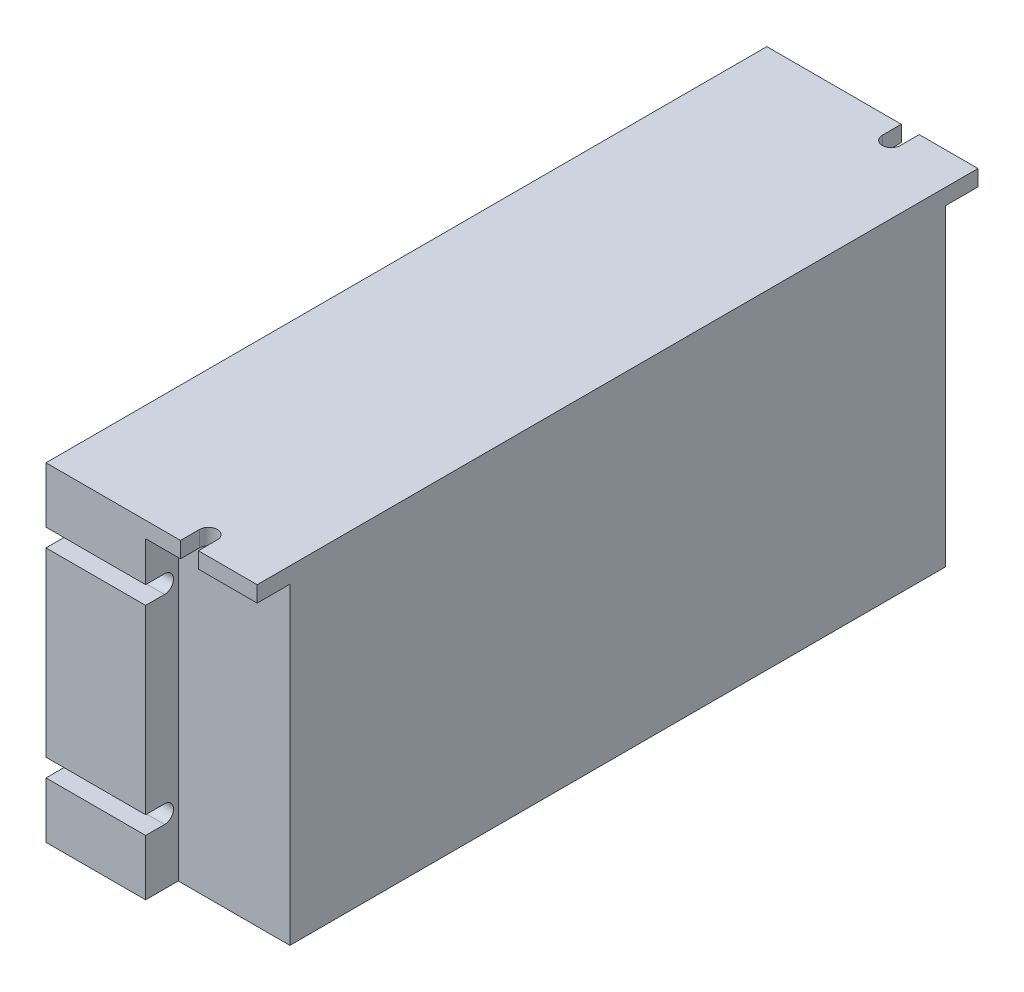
from build123d import *

# Parameters (mm, degrees)
SKETCH_2_W          = 180.9
SKETCH_2_H          = 82.5
EXTRUDE_1_DEPTH     = 53
SKETCH_3_W          = 8.2
SKETCH_3_H          = 78.5
CUT_EXTRUDE_1_DEPTH = 28
CUT_EXTRUDE_2_DEPTH = 25
CUT_EXTRUDE_3_DEPTH = 4


with BuildPart() as part:
    # Sketch 2 → Extrude 1 (new body)
    with BuildSketch(Plane(origin=(0, 0, 0), x_dir=(0, 0, -1), z_dir=(1, 0, 0))):
        Rectangle(SKETCH_2_W, SKETCH_2_H)
    extrude(amount=EXTRUDE_1_DEPTH)

    # Sketch 3 → Cut-Extrude 1 (cut)
    with BuildSketch(Plane(origin=(53, 0, 0), x_dir=(0, 0, -1), z_dir=(1, 0, 0))):
        with Locations((-86.35, -2)):
            Rectangle(SKETCH_3_W, SKETCH_3_H)
        with Locations((86.35, -2)):
            Rectangle(SKETCH_3_W, SKETCH_3_H)
    extrude(amount=-CUT_EXTRUDE_1_DEPTH, mode=Mode.SUBTRACT)

    # Sketch 4 → Cut-Extrude 2 (cut)
    with BuildSketch(Plane(origin=(25, 0, 0), x_dir=(0, 0, -1), z_dir=(1, 0, 0))):
        with BuildLine():
            Line((-85.7, -22.75), (-90.45, -22.75))
            Line((-90.45, -22.75), (-90.45, -27.25))
            Line((-90.45, -27.25), (-85.7, -27.25))
            ThreePointArc((-85.7, -27.25), (-83.45, -25), (-85.7, -22.75))
        make_face()
        with BuildLine():
            Line((-85.7, 27.25), (-90.45, 27.25))
            Line((-90.45, 27.25), (-90.45, 22.75))
            Line((-90.45, 22.75), (-85.7, 22.75))
            ThreePointArc((-85.7, 22.75), (-83.45, 25), (-85.7, 27.25))
        make_face()
        with BuildLine():
            Line((85.7, 22.75), (90.45, 22.75))
            Line((90.45, 22.75), (90.45, 27.25))
            Line((90.45, 27.25), (85.7, 27.25))
            ThreePointArc((85.7, 27.25), (83.45, 25), (85.7, 22.75))
        make_face()
        with BuildLine():
            Line((85.7, -22.75), (90.45, -22.75))
            Line((90.45, -22.75), (90.45, -27.25))
            Line((90.45, -27.25), (85.7, -27.25))
            ThreePointArc((85.7, -27.25), (83.45, -25), (85.7, -22.75))
        make_face()
    extrude(amount=-CUT_EXTRUDE_2_DEPTH, mode=Mode.SUBTRACT)

    # Sketch 5 → Cut-Extrude 3 (cut)
    with BuildSketch(Plane(origin=(0, 41.25, 0), x_dir=(1, 0, 0), z_dir=(0, 1, 0))):
        with BuildLine():
            Line((38.25, -85.7), (38.25, -90.45))
            Line((38.25, -90.45), (33.75, -90.45))
            Line((33.75, -90.45), (33.75, -85.7))
            ThreePointArc((33.75, -85.7), (36, -83.45), (38.25, -85.7))
        make_face()
        with BuildLine():
            Line((33.75, 85.7), (33.75, 90.45))
            Line((33.75, 90.45), (38.25, 90.45))
            Line((38.25, 90.45), (38.25, 85.7))
            ThreePointArc((38.25, 85.7), (36, 83.45), (33.75, 85.7))
        make_face()
    extrude(amount=-CUT_EXTRUDE_3_DEPTH, mode=Mode.SUBTRACT)


solid = part.part
